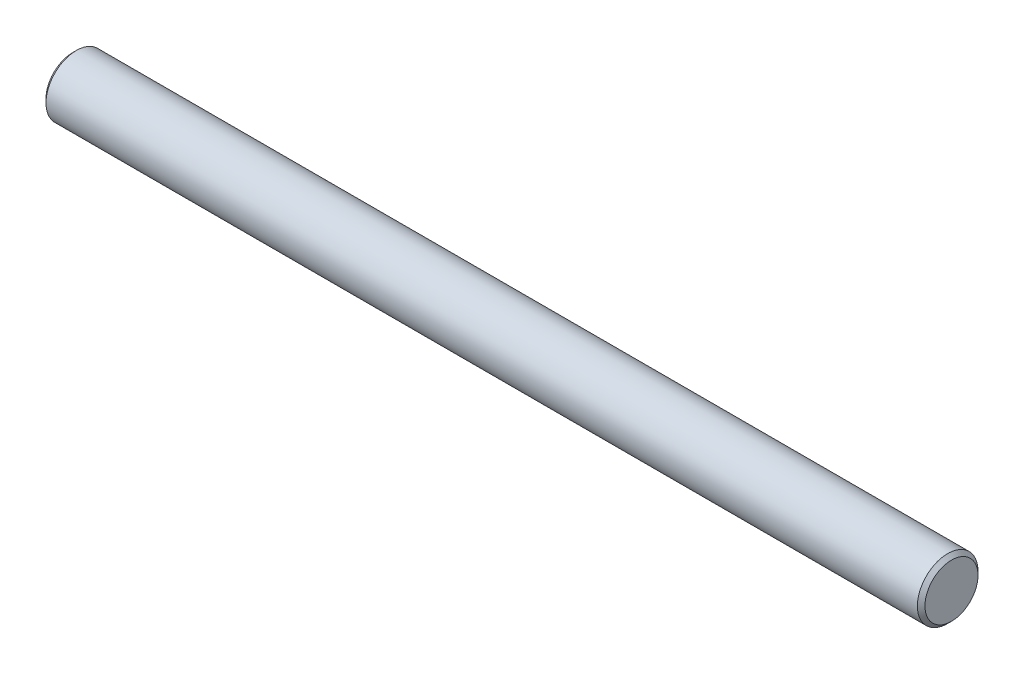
from build123d import *

# Parameters (mm, degrees)
SKETCH1_R      = 8
EXTRUDE1_DEPTH = 232
CHAMFER1_SIZE  = 1


with BuildPart() as part:
    # Sketch1 → Extrude1 (new body)
    with BuildSketch(Plane(origin=(0, 0, 0), x_dir=(0, 0, -1), z_dir=(1, 0, 0))):
        with Locations(Location((0, 0, 0), (0, 0, 180))):
            Circle(SKETCH1_R)
    extrude(amount=EXTRUDE1_DEPTH)

    # Chamfer1
    chamfer1_edges = [part.edges().sort_by_distance(p)[0] for p in [
        (0, 0, -8),
        (232, 0, -8),
    ]]
    chamfer(chamfer1_edges, length=CHAMFER1_SIZE)


solid = part.part
